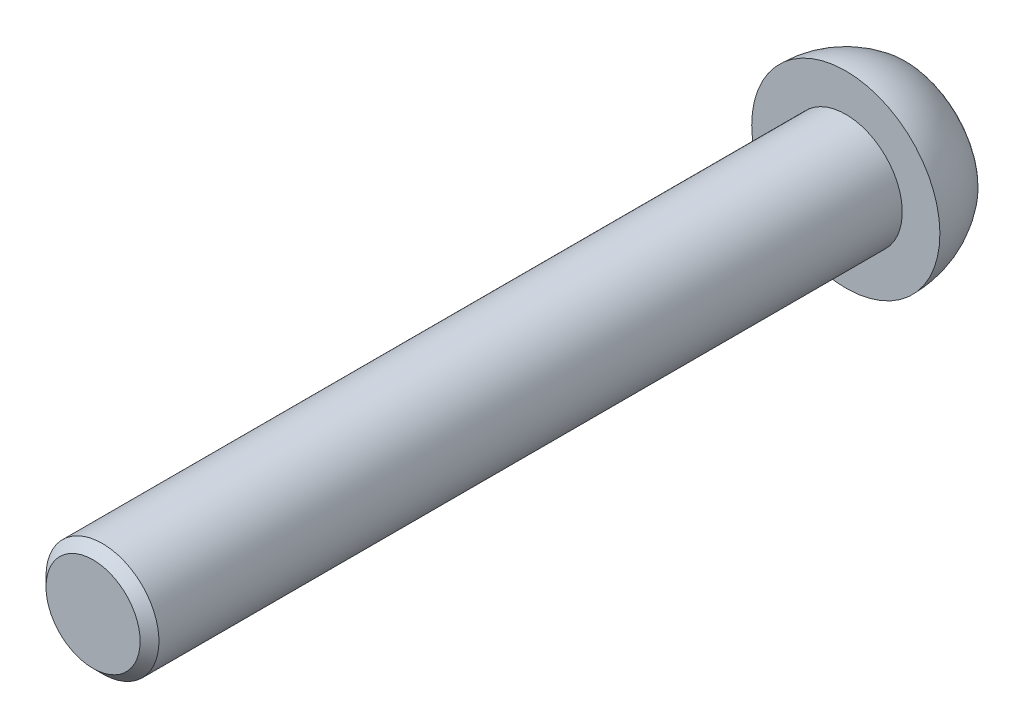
ISO-10303-21;
HEADER;
FILE_DESCRIPTION(('STEP AP214'),'2;1');
FILE_NAME('part.step','',(''),(''),'','','');
FILE_SCHEMA(('AUTOMOTIVE_DESIGN { 1 0 10303 214 1 1 1 1 }'));
ENDSEC;
DATA;
#1=APPLICATION_CONTEXT('core data for automotive mechanical design processes');
#2=APPLICATION_PROTOCOL_DEFINITION('international standard','automotive_design',2000,#1);
#3=PRODUCT_CONTEXT('',#1,'mechanical');
#4=PRODUCT('Part','Part','',(#3));
#5=PRODUCT_RELATED_PRODUCT_CATEGORY('part','',(#4));
#6=PRODUCT_DEFINITION_FORMATION('','',#4);
#7=PRODUCT_DEFINITION_CONTEXT('part definition',#1,'design');
#8=PRODUCT_DEFINITION('design','',#6,#7);
#9=PRODUCT_DEFINITION_SHAPE('','',#8);
#10=(LENGTH_UNIT() NAMED_UNIT(*) SI_UNIT(.MILLI.,.METRE.));
#11=(NAMED_UNIT(*) PLANE_ANGLE_UNIT() SI_UNIT($,.RADIAN.));
#12=(NAMED_UNIT(*) SI_UNIT($,.STERADIAN.) SOLID_ANGLE_UNIT());
#13=UNCERTAINTY_MEASURE_WITH_UNIT(LENGTH_MEASURE(1.E-05),#10,'distance_accuracy_value','');
#14=(GEOMETRIC_REPRESENTATION_CONTEXT(3) GLOBAL_UNCERTAINTY_ASSIGNED_CONTEXT((#13)) GLOBAL_UNIT_ASSIGNED_CONTEXT((#10,
#11,#12)) REPRESENTATION_CONTEXT('',''));
#15=CARTESIAN_POINT('',(0.,0.,0.));
#16=DIRECTION('',(0.,0.,1.));
#17=DIRECTION('',(1.,0.,0.));
#18=AXIS2_PLACEMENT_3D('',#15,#16,#17);
#19=CARTESIAN_POINT('',(-62.1361919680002,258.189999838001,-24.0000000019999));
#20=DIRECTION('',(0.,0.,-0.999999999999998));
#21=DIRECTION('',(0.99035023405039,0.138587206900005,0.));
#22=AXIS2_PLACEMENT_3D('',#19,#20,#21);
#23=PLANE('',#22);
#24=DIRECTION('',(0.3751550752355,0.926962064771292,0.));
#25=VECTOR('',#24,1.);
#26=CARTESIAN_POINT('',(-61.2958197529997,257.113059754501,-24.0000000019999));
#27=LINE('',#26,#25);
#28=CARTESIAN_POINT('',(-61.8082911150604,255.846806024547,-24.0000000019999));
#29=VERTEX_POINT('',#28);
#30=CARTESIAN_POINT('',(-60.7833483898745,258.379313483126,-24.0000000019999));
#31=VERTEX_POINT('',#30);
#32=EDGE_CURVE('E123',#29,#31,#27,.T.);
#33=ORIENTED_EDGE('',*,*,#32,.T.);
#34=DIRECTION('',(0.990350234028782,0.13858720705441,0.));
#35=VECTOR('',#34,1.);
#36=CARTESIAN_POINT('',(-59.4305048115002,258.568627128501,-24.0000000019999));
#37=LINE('',#36,#35);
#38=CARTESIAN_POINT('',(-58.0776612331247,258.757940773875,-24.0000000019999));
#39=VERTEX_POINT('',#38);
#40=EDGE_CURVE('E103',#31,#39,#37,.T.);
#41=ORIENTED_EDGE('',*,*,#40,.T.);
#42=DIRECTION('',(0.615195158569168,-0.788374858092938,0.));
#43=VECTOR('',#42,1.);
#44=CARTESIAN_POINT('',(-57.2372890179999,257.681000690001,-24.0000000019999));
#45=LINE('',#44,#43);
#46=CARTESIAN_POINT('',(-56.3969168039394,256.604060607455,-24.0000000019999));
#47=VERTEX_POINT('',#46);
#48=EDGE_CURVE('E99',#39,#47,#45,.T.);
#49=ORIENTED_EDGE('',*,*,#48,.T.);
#50=DIRECTION('',(-0.375155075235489,-0.926962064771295,0.));
#51=VECTOR('',#50,1.);
#52=CARTESIAN_POINT('',(-56.9093881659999,255.337806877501,-24.0000000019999));
#53=LINE('',#52,#51);
#54=CARTESIAN_POINT('',(-57.4218595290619,254.071553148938,-24.0000000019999));
#55=VERTEX_POINT('',#54);
#56=EDGE_CURVE('E101',#47,#55,#53,.T.);
#57=ORIENTED_EDGE('',*,*,#56,.T.);
#58=DIRECTION('',(-0.990350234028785,-0.13858720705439,0.));
#59=VECTOR('',#58,1.);
#60=CARTESIAN_POINT('',(-58.7747031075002,253.882239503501,-24.0000000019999));
#61=LINE('',#60,#59);
#62=CARTESIAN_POINT('',(-60.1275466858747,253.692925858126,-24.0000000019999));
#63=VERTEX_POINT('',#62);
#64=EDGE_CURVE('E85',#55,#63,#61,.T.);
#65=ORIENTED_EDGE('',*,*,#64,.T.);
#66=DIRECTION('',(-0.615195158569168,0.788374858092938,0.));
#67=VECTOR('',#66,1.);
#68=CARTESIAN_POINT('',(-60.9679189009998,254.769865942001,-24.0000000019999));
#69=LINE('',#68,#67);
#70=EDGE_CURVE('E130',#63,#29,#69,.T.);
#71=ORIENTED_EDGE('',*,*,#70,.T.);
#72=EDGE_LOOP('',(#33,#41,#49,#57,#65,#71));
#73=FACE_BOUND('',#72,.T.);
#74=ADVANCED_FACE('F30',(#73),#23,.T.);
#75=CARTESIAN_POINT('',(-59.1026039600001,256.225433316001,-8.000000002));
#76=DIRECTION('',(0.,0.,-0.999999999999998));
#77=DIRECTION('',(-1.,0.,0.));
#78=AXIS2_PLACEMENT_3D('',#75,#76,#77);
#79=CYLINDRICAL_SURFACE('',#78,3.00000000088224);
#80=CARTESIAN_POINT('',(-59.1026039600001,256.225433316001,16.4999999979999));
#81=DIRECTION('',(0.,0.,1.));
#82=DIRECTION('',(1.,0.,0.));
#83=AXIS2_PLACEMENT_3D('',#80,#81,#82);
#84=CIRCLE('',#83,3.00000000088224);
#85=CARTESIAN_POINT('',(-62.1026039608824,256.225433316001,16.4999999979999));
#86=VERTEX_POINT('',#85);
#87=EDGE_CURVE('E11',#86,#86,#84,.F.);
#88=CARTESIAN_POINT('',(-59.1026039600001,256.225433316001,-23.000000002));
#89=DIRECTION('',(0.,0.,-0.999999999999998));
#90=DIRECTION('',(-1.,0.,0.));
#91=AXIS2_PLACEMENT_3D('',#88,#89,#90);
#92=CIRCLE('',#91,3.00000000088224);
#93=CARTESIAN_POINT('',(-62.1026039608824,256.225433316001,-23.000000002));
#94=VERTEX_POINT('',#93);
#95=EDGE_CURVE('E144',#94,#94,#92,.F.);
#96=CARTESIAN_POINT('',(-62.1026039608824,256.225433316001,16.4999999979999));
#97=CARTESIAN_POINT('',(-62.1026039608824,256.225433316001,16.0885416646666));
#98=CARTESIAN_POINT('',(-62.1026039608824,256.225433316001,15.6770833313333));
#99=CARTESIAN_POINT('',(-62.1026039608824,256.225433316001,14.8541666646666));
#100=CARTESIAN_POINT('',(-62.1026039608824,256.225433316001,14.4427083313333));
#101=CARTESIAN_POINT('',(-62.1026039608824,256.225433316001,13.6197916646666));
#102=CARTESIAN_POINT('',(-62.1026039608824,256.225433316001,13.2083333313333));
#103=CARTESIAN_POINT('',(-62.1026039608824,256.225433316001,12.3854166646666));
#104=CARTESIAN_POINT('',(-62.1026039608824,256.225433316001,11.9739583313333));
#105=CARTESIAN_POINT('',(-62.1026039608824,256.225433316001,11.1510416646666));
#106=CARTESIAN_POINT('',(-62.1026039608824,256.225433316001,10.7395833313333));
#107=CARTESIAN_POINT('',(-62.1026039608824,256.225433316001,9.91666666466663));
#108=CARTESIAN_POINT('',(-62.1026039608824,256.225433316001,9.5052083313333));
#109=CARTESIAN_POINT('',(-62.1026039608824,256.225433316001,8.68229166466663));
#110=CARTESIAN_POINT('',(-62.1026039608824,256.225433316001,8.2708333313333));
#111=CARTESIAN_POINT('',(-62.1026039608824,256.225433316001,7.44791666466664));
#112=CARTESIAN_POINT('',(-62.1026039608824,256.225433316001,7.0364583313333));
#113=CARTESIAN_POINT('',(-62.1026039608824,256.225433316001,6.21354166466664));
#114=CARTESIAN_POINT('',(-62.1026039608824,256.225433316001,5.80208333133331));
#115=CARTESIAN_POINT('',(-62.1026039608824,256.225433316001,4.97916666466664));
#116=CARTESIAN_POINT('',(-62.1026039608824,256.225433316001,4.56770833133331));
#117=CARTESIAN_POINT('',(-62.1026039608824,256.225433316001,3.74479166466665));
#118=CARTESIAN_POINT('',(-62.1026039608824,256.225433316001,3.33333333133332));
#119=CARTESIAN_POINT('',(-62.1026039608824,256.225433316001,2.51041666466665));
#120=CARTESIAN_POINT('',(-62.1026039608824,256.225433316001,2.09895833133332));
#121=CARTESIAN_POINT('',(-62.1026039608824,256.225433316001,1.27604166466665));
#122=CARTESIAN_POINT('',(-62.1026039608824,256.225433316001,0.86458333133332));
#123=CARTESIAN_POINT('',(-62.1026039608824,256.225433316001,0.0416666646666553));
#124=CARTESIAN_POINT('',(-62.1026039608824,256.225433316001,-0.369791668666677));
#125=CARTESIAN_POINT('',(-62.1026039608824,256.225433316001,-1.19270833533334));
#126=CARTESIAN_POINT('',(-62.1026039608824,256.225433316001,-1.60416666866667));
#127=CARTESIAN_POINT('',(-62.1026039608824,256.225433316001,-2.42708333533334));
#128=CARTESIAN_POINT('',(-62.1026039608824,256.225433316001,-2.83854166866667));
#129=CARTESIAN_POINT('',(-62.1026039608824,256.225433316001,-3.66145833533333));
#130=CARTESIAN_POINT('',(-62.1026039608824,256.225433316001,-4.07291666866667));
#131=CARTESIAN_POINT('',(-62.1026039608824,256.225433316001,-4.89583333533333));
#132=CARTESIAN_POINT('',(-62.1026039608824,256.225433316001,-5.30729166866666));
#133=CARTESIAN_POINT('',(-62.1026039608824,256.225433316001,-6.13020833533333));
#134=CARTESIAN_POINT('',(-62.1026039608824,256.225433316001,-6.54166666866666));
#135=CARTESIAN_POINT('',(-62.1026039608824,256.225433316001,-7.36458333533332));
#136=CARTESIAN_POINT('',(-62.1026039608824,256.225433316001,-7.77604166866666));
#137=CARTESIAN_POINT('',(-62.1026039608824,256.225433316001,-8.59895833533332));
#138=CARTESIAN_POINT('',(-62.1026039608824,256.225433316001,-9.01041666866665));
#139=CARTESIAN_POINT('',(-62.1026039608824,256.225433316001,-9.83333333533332));
#140=CARTESIAN_POINT('',(-62.1026039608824,256.225433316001,-10.2447916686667));
#141=CARTESIAN_POINT('',(-62.1026039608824,256.225433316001,-11.0677083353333));
#142=CARTESIAN_POINT('',(-62.1026039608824,256.225433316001,-11.4791666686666));
#143=CARTESIAN_POINT('',(-62.1026039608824,256.225433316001,-12.3020833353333));
#144=CARTESIAN_POINT('',(-62.1026039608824,256.225433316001,-12.7135416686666));
#145=CARTESIAN_POINT('',(-62.1026039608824,256.225433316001,-13.5364583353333));
#146=CARTESIAN_POINT('',(-62.1026039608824,256.225433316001,-13.9479166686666));
#147=CARTESIAN_POINT('',(-62.1026039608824,256.225433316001,-14.7708333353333));
#148=CARTESIAN_POINT('',(-62.1026039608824,256.225433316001,-15.1822916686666));
#149=CARTESIAN_POINT('',(-62.1026039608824,256.225433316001,-16.0052083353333));
#150=CARTESIAN_POINT('',(-62.1026039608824,256.225433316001,-16.4166666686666));
#151=CARTESIAN_POINT('',(-62.1026039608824,256.225433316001,-17.2395833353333));
#152=CARTESIAN_POINT('',(-62.1026039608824,256.225433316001,-17.6510416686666));
#153=CARTESIAN_POINT('',(-62.1026039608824,256.225433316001,-18.4739583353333));
#154=CARTESIAN_POINT('',(-62.1026039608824,256.225433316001,-18.8854166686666));
#155=CARTESIAN_POINT('',(-62.1026039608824,256.225433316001,-19.7083333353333));
#156=CARTESIAN_POINT('',(-62.1026039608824,256.225433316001,-20.1197916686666));
#157=CARTESIAN_POINT('',(-62.1026039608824,256.225433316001,-20.9427083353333));
#158=CARTESIAN_POINT('',(-62.1026039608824,256.225433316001,-21.3541666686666));
#159=CARTESIAN_POINT('',(-62.1026039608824,256.225433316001,-22.1770833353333));
#160=CARTESIAN_POINT('',(-62.1026039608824,256.225433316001,-22.5885416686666));
#161=CARTESIAN_POINT('',(-62.1026039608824,256.225433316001,-23.000000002));
#162=B_SPLINE_CURVE_WITH_KNOTS('',3,(#96,#97,#98,#99,#100,#101,#102,#103,#104,#105,#106,#107,
#108,#109,#110,#111,#112,#113,#114,#115,#116,#117,#118,#119,#120,#121,#122,#123,#124,#125,#126,
#127,#128,#129,#130,#131,#132,#133,#134,#135,#136,#137,#138,#139,#140,#141,#142,#143,#144,#145,
#146,#147,#148,#149,#150,#151,#152,#153,#154,#155,#156,#157,#158,#159,#160,#161),.UNSPECIFIED.,
.F.,.F.,(4,2,2,2,2,2,2,2,2,2,2,2,2,2,2,2,2,2,2,2,2,2,2,2,2,2,2,2,2,2,2,2,4),(0.,1.234375,
2.46874999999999,3.70312499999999,4.93749999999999,6.17187499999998,7.40624999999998,
8.64062499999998,9.87499999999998,11.109375,12.34375,13.578125,14.8125,16.046875,17.28125,
18.515625,19.7499999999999,20.9843749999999,22.2187499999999,23.4531249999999,24.6874999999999,
25.9218749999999,27.1562499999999,28.3906249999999,29.6249999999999,30.8593749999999,
32.0937499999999,33.3281249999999,34.5624999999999,35.7968749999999,37.0312499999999,
38.2656249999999,39.4999999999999),.UNSPECIFIED.);
#163=EDGE_CURVE('BSEAM187',#86,#94,#162,.T.);
#164=ORIENTED_EDGE('',*,*,#87,.T.);
#165=ORIENTED_EDGE('',*,*,#95,.T.);
#166=ORIENTED_EDGE('',*,*,#163,.T.);
#167=ORIENTED_EDGE('',*,*,#163,.F.);
#168=EDGE_LOOP('',(#164,#166,#165,#167));
#169=FACE_BOUND('',#168,.T.);
#170=ADVANCED_FACE('F187',(#169),#79,.T.);
#171=CARTESIAN_POINT('',(-57.4218595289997,254.071553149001,-26.3000000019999));
#172=DIRECTION('',(0.926962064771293,-0.375155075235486,0.));
#173=DIRECTION('',(0.375155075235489,0.926962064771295,0.));
#174=AXIS2_PLACEMENT_3D('',#171,#172,#173);
#175=PLANE('',#174);
#176=DIRECTION('',(0.,0.,0.999999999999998));
#177=VECTOR('',#176,1.);
#178=CARTESIAN_POINT('',(-57.4218595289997,254.071553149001,-25.1500000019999));
#179=LINE('',#178,#177);
#180=CARTESIAN_POINT('',(-57.4218595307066,254.071553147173,-26.3000000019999));
#181=VERTEX_POINT('',#180);
#182=EDGE_CURVE('E111',#181,#55,#179,.T.);
#183=ORIENTED_EDGE('',*,*,#182,.T.);
#184=ORIENTED_EDGE('',*,*,#56,.F.);
#185=DIRECTION('',(0.,0.,-0.999999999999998));
#186=VECTOR('',#185,1.);
#187=CARTESIAN_POINT('',(-56.396916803,256.604060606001,-25.1500000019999));
#188=LINE('',#187,#186);
#189=CARTESIAN_POINT('',(-56.3969168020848,256.604060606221,-26.3000000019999));
#190=VERTEX_POINT('',#189);
#191=EDGE_CURVE('E107',#47,#190,#188,.T.);
#192=ORIENTED_EDGE('',*,*,#191,.T.);
#193=DIRECTION('',(0.37515507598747,0.926962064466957,0.));
#194=VECTOR('',#193,1.);
#195=CARTESIAN_POINT('',(-57.4218595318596,254.07155314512,-26.3000000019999));
#196=LINE('',#195,#194);
#197=EDGE_CURVE('E76',#181,#190,#196,.T.);
#198=ORIENTED_EDGE('',*,*,#197,.F.);
#199=EDGE_LOOP('',(#183,#184,#192,#198));
#200=FACE_BOUND('',#199,.T.);
#201=ADVANCED_FACE('F109',(#200),#175,.F.);
#202=CARTESIAN_POINT('',(-56.396916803,256.604060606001,-26.3000000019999));
#203=DIRECTION('',(0.788374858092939,0.615195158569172,0.));
#204=DIRECTION('',(-0.615195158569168,0.788374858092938,0.));
#205=AXIS2_PLACEMENT_3D('',#202,#203,#204);
#206=PLANE('',#205);
#207=ORIENTED_EDGE('',*,*,#191,.F.);
#208=ORIENTED_EDGE('',*,*,#48,.F.);
#209=DIRECTION('',(0.,0.,-0.999999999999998));
#210=VECTOR('',#209,1.);
#211=CARTESIAN_POINT('',(-58.0776612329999,258.757940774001,-25.1500000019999));
#212=LINE('',#211,#210);
#213=CARTESIAN_POINT('',(-58.077661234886,258.757940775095,-26.3000000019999));
#214=VERTEX_POINT('',#213);
#215=EDGE_CURVE('E117',#39,#214,#212,.T.);
#216=ORIENTED_EDGE('',*,*,#215,.T.);
#217=DIRECTION('',(-0.615195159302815,0.788374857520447,0.));
#218=VECTOR('',#217,1.);
#219=CARTESIAN_POINT('',(-56.3969168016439,256.604060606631,-26.3000000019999));
#220=LINE('',#219,#218);
#221=EDGE_CURVE('E115',#190,#214,#220,.T.);
#222=ORIENTED_EDGE('',*,*,#221,.F.);
#223=EDGE_LOOP('',(#207,#208,#216,#222));
#224=FACE_BOUND('',#223,.T.);
#225=ADVANCED_FACE('F113',(#224),#206,.F.);
#226=CARTESIAN_POINT('',(-58.0776612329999,258.757940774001,-24.0000000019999));
#227=DIRECTION('',(-0.138587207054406,0.990350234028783,0.));
#228=DIRECTION('',(0.,0.,-0.999999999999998));
#229=AXIS2_PLACEMENT_3D('',#226,#227,#228);
#230=PLANE('',#229);
#231=ORIENTED_EDGE('',*,*,#215,.F.);
#232=ORIENTED_EDGE('',*,*,#40,.F.);
#233=DIRECTION('',(0.,0.,-0.999999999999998));
#234=VECTOR('',#233,1.);
#235=CARTESIAN_POINT('',(-60.7833483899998,258.379313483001,-25.1500000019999));
#236=LINE('',#235,#234);
#237=CARTESIAN_POINT('',(-60.7833483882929,258.379313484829,-26.3000000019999));
#238=VERTEX_POINT('',#237);
#239=EDGE_CURVE('E128',#31,#238,#236,.T.);
#240=ORIENTED_EDGE('',*,*,#239,.T.);
#241=DIRECTION('',(-0.990350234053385,-0.138587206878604,0.));
#242=VECTOR('',#241,1.);
#243=CARTESIAN_POINT('',(-59.4305048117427,258.568627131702,-26.3000000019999));
#244=LINE('',#243,#242);
#245=EDGE_CURVE('E124',#214,#238,#244,.T.);
#246=ORIENTED_EDGE('',*,*,#245,.F.);
#247=EDGE_LOOP('',(#231,#232,#240,#246));
#248=FACE_BOUND('',#247,.T.);
#249=ADVANCED_FACE('F214',(#248),#230,.F.);
#250=CARTESIAN_POINT('',(-60.7833483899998,258.379313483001,-26.3000000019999));
#251=DIRECTION('',(-0.926962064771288,0.375155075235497,0.));
#252=DIRECTION('',(-0.3751550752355,-0.926962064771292,0.));
#253=AXIS2_PLACEMENT_3D('',#250,#251,#252);
#254=PLANE('',#253);
#255=ORIENTED_EDGE('',*,*,#239,.F.);
#256=ORIENTED_EDGE('',*,*,#32,.F.);
#257=DIRECTION('',(0.,0.,-0.999999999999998));
#258=VECTOR('',#257,1.);
#259=CARTESIAN_POINT('',(-61.8082911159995,255.846806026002,-25.1500000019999));
#260=LINE('',#259,#258);
#261=CARTESIAN_POINT('',(-61.8082911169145,255.846806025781,-26.3000000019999));
#262=VERTEX_POINT('',#261);
#263=EDGE_CURVE('E208',#29,#262,#260,.T.);
#264=ORIENTED_EDGE('',*,*,#263,.T.);
#265=DIRECTION('',(-0.375155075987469,-0.926962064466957,0.));
#266=VECTOR('',#265,1.);
#267=CARTESIAN_POINT('',(-60.7833483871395,258.379313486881,-26.3000000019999));
#268=LINE('',#267,#266);
#269=EDGE_CURVE('E127',#238,#262,#268,.T.);
#270=ORIENTED_EDGE('',*,*,#269,.F.);
#271=EDGE_LOOP('',(#255,#256,#264,#270));
#272=FACE_BOUND('',#271,.T.);
#273=ADVANCED_FACE('F217',(#272),#254,.F.);
#274=CARTESIAN_POINT('',(-61.8082911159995,255.846806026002,-26.3000000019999));
#275=DIRECTION('',(-0.788374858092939,-0.615195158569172,0.));
#276=DIRECTION('',(0.615195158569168,-0.788374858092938,0.));
#277=AXIS2_PLACEMENT_3D('',#274,#275,#276);
#278=PLANE('',#277);
#279=ORIENTED_EDGE('',*,*,#263,.F.);
#280=ORIENTED_EDGE('',*,*,#70,.F.);
#281=DIRECTION('',(0.,0.,-0.999999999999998));
#282=VECTOR('',#281,1.);
#283=CARTESIAN_POINT('',(-60.1275466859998,253.692925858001,-25.1500000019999));
#284=LINE('',#283,#282);
#285=CARTESIAN_POINT('',(-60.1275466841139,253.692925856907,-26.3000000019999));
#286=VERTEX_POINT('',#285);
#287=EDGE_CURVE('E206',#63,#286,#284,.T.);
#288=ORIENTED_EDGE('',*,*,#287,.T.);
#289=DIRECTION('',(0.615195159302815,-0.788374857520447,0.));
#290=VECTOR('',#289,1.);
#291=CARTESIAN_POINT('',(-61.8082911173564,255.84680602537,-26.3000000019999));
#292=LINE('',#291,#290);
#293=EDGE_CURVE('E135',#262,#286,#292,.T.);
#294=ORIENTED_EDGE('',*,*,#293,.F.);
#295=EDGE_LOOP('',(#279,#280,#288,#294));
#296=FACE_BOUND('',#295,.T.);
#297=ADVANCED_FACE('F289',(#296),#278,.F.);
#298=CARTESIAN_POINT('',(-57.4218595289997,254.071553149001,-26.3000000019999));
#299=DIRECTION('',(0.138587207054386,-0.990350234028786,0.));
#300=DIRECTION('',(0.,0.,0.999999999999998));
#301=AXIS2_PLACEMENT_3D('',#298,#299,#300);
#302=PLANE('',#301);
#303=ORIENTED_EDGE('',*,*,#287,.F.);
#304=ORIENTED_EDGE('',*,*,#64,.F.);
#305=ORIENTED_EDGE('',*,*,#182,.F.);
#306=DIRECTION('',(0.990350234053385,0.138587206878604,0.));
#307=VECTOR('',#306,1.);
#308=CARTESIAN_POINT('',(-58.7747031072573,253.8822395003,-26.3000000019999));
#309=LINE('',#308,#307);
#310=EDGE_CURVE('E138',#286,#181,#309,.T.);
#311=ORIENTED_EDGE('',*,*,#310,.F.);
#312=EDGE_LOOP('',(#303,#304,#305,#311));
#313=FACE_BOUND('',#312,.T.);
#314=ADVANCED_FACE('F186',(#313),#302,.F.);
#315=CARTESIAN_POINT('',(-59.5908166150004,259.714222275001,-26.300000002));
#316=CARTESIAN_POINT('',(-52.6132386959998,260.690647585,-26.300000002));
#317=CARTESIAN_POINT('',(-51.6368133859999,253.713069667,-26.300000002));
#318=CARTESIAN_POINT('',(-58.614391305,252.736644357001,-26.3000000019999));
#319=CARTESIAN_POINT('',(-59.612318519,259.867875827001,-26.3000000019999));
#320=CARTESIAN_POINT('',(-52.3274334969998,260.887304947,-26.3000000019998));
#321=CARTESIAN_POINT('',(-51.3080043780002,253.602419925,-26.3000000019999));
#322=CARTESIAN_POINT('',(-58.5928894,252.582990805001,-26.3000000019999));
#323=CARTESIAN_POINT('',(-59.6316835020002,260.006258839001,-26.2325694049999));
#324=CARTESIAN_POINT('',(-52.0700324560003,261.064417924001,-26.2325694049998));
#325=CARTESIAN_POINT('',(-51.0118733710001,253.502766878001,-26.2325694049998));
#326=CARTESIAN_POINT('',(-58.5735244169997,252.444607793,-26.2325694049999));
#327=CARTESIAN_POINT('',(-59.645062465,260.101865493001,-26.111111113));
#328=CARTESIAN_POINT('',(-51.8921981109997,261.186782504,-26.111111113));
#329=CARTESIAN_POINT('',(-50.8072811,253.433918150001,-26.111111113));
#330=CARTESIAN_POINT('',(-58.5601454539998,252.349001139,-26.1111111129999));
#331=(BOUNDED_SURFACE() B_SPLINE_SURFACE(3,3,((#315,#316,#317,#318),(#319,#320,#321,#322),(#323,
#324,#325,#326),(#327,#328,#329,#330)),.UNSPECIFIED.,.F.,.F.,
.F.) B_SPLINE_SURFACE_WITH_KNOTS((4,4),(4,4),(0.,1.),(0.,1.),
.UNSPECIFIED.) GEOMETRIC_REPRESENTATION_ITEM() RATIONAL_B_SPLINE_SURFACE(((1.,0.333333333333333,
0.333333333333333,1.),(0.933744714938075,0.311248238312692,0.311248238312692,0.933744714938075),
(0.933744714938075,0.311248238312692,0.311248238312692,0.933744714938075),(1.,0.333333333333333,
0.333333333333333,1.))) REPRESENTATION_ITEM('') SURFACE());
#332=CARTESIAN_POINT('',(-58.614391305,252.736644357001,-26.3000000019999));
#333=CARTESIAN_POINT('',(-58.5928894,252.582990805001,-26.3000000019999));
#334=CARTESIAN_POINT('',(-58.5735244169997,252.444607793,-26.2325694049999));
#335=CARTESIAN_POINT('',(-58.5601454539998,252.349001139,-26.1111111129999));
#336=(BOUNDED_CURVE() B_SPLINE_CURVE(3,(#332,#333,#334,#335),.UNSPECIFIED.,.F.,
.F.) B_SPLINE_CURVE_WITH_KNOTS((4,4),(0.,1.),
.UNSPECIFIED.) CURVE() GEOMETRIC_REPRESENTATION_ITEM() RATIONAL_B_SPLINE_CURVE((1.,
0.933744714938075,0.933744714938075,1.)) REPRESENTATION_ITEM(''));
#337=CARTESIAN_POINT('',(-58.5601454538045,252.349001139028,-26.1111111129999));
#338=VERTEX_POINT('',#337);
#339=CARTESIAN_POINT('',(-58.614391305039,252.736644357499,-26.3000000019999));
#340=VERTEX_POINT('',#339);
#341=EDGE_CURVE('E146',#338,#340,#336,.F.);
#342=CARTESIAN_POINT('',(-58.614391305,252.736644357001,-26.3000000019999));
#343=CARTESIAN_POINT('',(-51.6368133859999,253.713069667,-26.300000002));
#344=CARTESIAN_POINT('',(-52.6132386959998,260.690647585,-26.300000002));
#345=CARTESIAN_POINT('',(-59.5908166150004,259.714222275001,-26.300000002));
#346=(BOUNDED_CURVE() B_SPLINE_CURVE(3,(#342,#343,#344,#345),.UNSPECIFIED.,.F.,
.F.) B_SPLINE_CURVE_WITH_KNOTS((4,4),(0.,1.),
.UNSPECIFIED.) CURVE() GEOMETRIC_REPRESENTATION_ITEM() RATIONAL_B_SPLINE_CURVE((1.,
0.333333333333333,0.333333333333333,1.)) REPRESENTATION_ITEM(''));
#347=CARTESIAN_POINT('',(-59.5908166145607,259.714222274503,-26.300000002));
#348=VERTEX_POINT('',#347);
#349=EDGE_CURVE('E143',#348,#340,#346,.F.);
#350=CARTESIAN_POINT('',(-59.5908166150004,259.714222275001,-26.300000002));
#351=CARTESIAN_POINT('',(-59.612318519,259.867875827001,-26.3000000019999));
#352=CARTESIAN_POINT('',(-59.6316835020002,260.006258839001,-26.2325694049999));
#353=CARTESIAN_POINT('',(-59.645062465,260.101865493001,-26.111111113));
#354=(BOUNDED_CURVE() B_SPLINE_CURVE(3,(#350,#351,#352,#353),.UNSPECIFIED.,.F.,
.F.) B_SPLINE_CURVE_WITH_KNOTS((4,4),(0.,1.),
.UNSPECIFIED.) CURVE() GEOMETRIC_REPRESENTATION_ITEM() RATIONAL_B_SPLINE_CURVE((1.,
0.933744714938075,0.933744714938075,1.)) REPRESENTATION_ITEM(''));
#355=CARTESIAN_POINT('',(-59.6450624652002,260.101865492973,-26.111111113));
#356=VERTEX_POINT('',#355);
#357=EDGE_CURVE('E229',#348,#356,#354,.T.);
#358=CARTESIAN_POINT('',(-59.1026039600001,256.225433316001,-26.1111110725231));
#359=DIRECTION('',(0.,0.,-0.999999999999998));
#360=DIRECTION('',(-0.990350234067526,-0.138587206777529,0.));
#361=AXIS2_PLACEMENT_3D('',#358,#359,#360);
#362=CIRCLE('',#361,3.91420335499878);
#363=EDGE_CURVE('E134',#356,#338,#362,.T.);
#364=ORIENTED_EDGE('',*,*,#341,.T.);
#365=ORIENTED_EDGE('',*,*,#349,.F.);
#366=ORIENTED_EDGE('',*,*,#357,.T.);
#367=ORIENTED_EDGE('',*,*,#363,.T.);
#368=EDGE_LOOP('',(#364,#365,#366,#367));
#369=FACE_BOUND('',#368,.T.);
#370=ADVANCED_FACE('F173',(#369),#331,.T.);
#371=CARTESIAN_POINT('',(-64.8150274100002,260.535354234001,-23.000000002));
#372=DIRECTION('',(0.,0.,-0.999999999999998));
#373=DIRECTION('',(0.9903502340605,0.138587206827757,0.));
#374=AXIS2_PLACEMENT_3D('',#371,#372,#373);
#375=PLANE('',#374);
#376=ORIENTED_EDGE('',*,*,#95,.F.);
#377=EDGE_LOOP('',(#376));
#378=FACE_BOUND('',#377,.T.);
#379=CARTESIAN_POINT('',(-59.1026039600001,256.225433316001,-23.000000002));
#380=DIRECTION('',(0.,0.,-0.999999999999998));
#381=DIRECTION('',(-1.,0.,0.));
#382=AXIS2_PLACEMENT_3D('',#379,#380,#381);
#383=CIRCLE('',#382,4.99999999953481);
#384=CARTESIAN_POINT('',(-64.1026039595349,256.225433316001,-23.000000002));
#385=VERTEX_POINT('',#384);
#386=EDGE_CURVE('E131',#385,#385,#383,.F.);
#387=ORIENTED_EDGE('',*,*,#386,.T.);
#388=EDGE_LOOP('',(#387));
#389=FACE_BOUND('',#388,.T.);
#390=ADVANCED_FACE('F185',(#378,#389),#375,.F.);
#391=CARTESIAN_POINT('',(-56.0660207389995,260.250158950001,-26.300000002));
#392=DIRECTION('',(0.,0.,-0.999999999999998));
#393=DIRECTION('',(0.13858720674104,-0.990350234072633,0.));
#394=AXIS2_PLACEMENT_3D('',#391,#392,#393);
#395=PLANE('',#394);
#396=ORIENTED_EDGE('',*,*,#293,.T.);
#397=ORIENTED_EDGE('',*,*,#310,.T.);
#398=ORIENTED_EDGE('',*,*,#197,.T.);
#399=ORIENTED_EDGE('',*,*,#221,.T.);
#400=ORIENTED_EDGE('',*,*,#245,.T.);
#401=ORIENTED_EDGE('',*,*,#269,.T.);
#402=EDGE_LOOP('',(#396,#397,#398,#399,#400,#401));
#403=FACE_BOUND('',#402,.T.);
#404=CARTESIAN_POINT('',(-59.5908166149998,259.714222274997,-26.300000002));
#405=CARTESIAN_POINT('',(-59.6277319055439,259.709056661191,-26.300000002));
#406=CARTESIAN_POINT('',(-59.6645651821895,259.703304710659,-26.300000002));
#407=CARTESIAN_POINT('',(-59.739195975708,259.690433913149,-26.300000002));
#408=CARTESIAN_POINT('',(-59.7769870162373,259.683277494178,-26.300000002));
#409=CARTESIAN_POINT('',(-59.853507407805,259.667484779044,-26.300000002));
#410=CARTESIAN_POINT('',(-59.8922285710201,259.658808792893,-26.300000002));
#411=CARTESIAN_POINT('',(-59.9705737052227,259.639859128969,-26.300000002));
#412=CARTESIAN_POINT('',(-60.0101875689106,259.62954364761,-26.300000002));
#413=CARTESIAN_POINT('',(-60.0902717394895,259.607192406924,-26.300000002));
#414=CARTESIAN_POINT('',(-60.1307297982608,259.595112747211,-26.300000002));
#415=CARTESIAN_POINT('',(-60.2124438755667,259.569106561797,-26.300000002));
#416=CARTESIAN_POINT('',(-60.2536852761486,259.555134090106,-26.300000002));
#417=CARTESIAN_POINT('',(-60.3368941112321,259.525212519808,-26.300000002));
#418=CARTESIAN_POINT('',(-60.3788443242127,259.509215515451,-26.300000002));
#419=CARTESIAN_POINT('',(-60.4633840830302,259.475113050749,-26.300000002));
#420=CARTESIAN_POINT('',(-60.5059535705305,259.456957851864,-26.300000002));
#421=CARTESIAN_POINT('',(-60.5916290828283,259.418406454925,-26.300000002));
#422=CARTESIAN_POINT('',(-60.6347119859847,259.397958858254,-26.300000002));
#423=CARTESIAN_POINT('',(-60.7212941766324,259.354691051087,-26.300000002));
#424=CARTESIAN_POINT('',(-60.7647670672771,259.331818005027,-26.300000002));
#425=CARTESIAN_POINT('',(-60.851990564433,259.283570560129,-26.300000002));
#426=CARTESIAN_POINT('',(-60.8957113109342,259.2581421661,-26.300000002));
#427=CARTESIAN_POINT('',(-60.9832723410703,259.204660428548,-26.300000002));
#428=CARTESIAN_POINT('',(-61.0270791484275,259.176552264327,-26.300000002));
#429=CARTESIAN_POINT('',(-61.1146338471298,259.117595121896,-26.300000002));
#430=CARTESIAN_POINT('',(-61.158344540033,259.086690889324,-26.300000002));
#431=CARTESIAN_POINT('',(-61.2455078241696,259.022036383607,-26.300000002));
#432=CARTESIAN_POINT('',(-61.2889194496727,258.98823087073,-26.300000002));
#433=CARTESIAN_POINT('',(-61.3752646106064,258.917682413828,-26.300000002));
#434=CARTESIAN_POINT('',(-61.4181534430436,258.880884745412,-26.300000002));
#435=CARTESIAN_POINT('',(-61.503212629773,258.804277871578,-26.300000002));
#436=CARTESIAN_POINT('',(-61.5453346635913,258.764415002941,-26.300000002));
#437=CARTESIAN_POINT('',(-61.6286004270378,258.681624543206,-26.300000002));
#438=CARTESIAN_POINT('',(-61.6696924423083,258.638644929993,-26.300000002));
#439=CARTESIAN_POINT('',(-61.7506205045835,258.549592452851,-26.300000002));
#440=CARTESIAN_POINT('',(-61.7904017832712,258.503469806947,-26.300000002));
#441=CARTESIAN_POINT('',(-61.8684151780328,258.408131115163,-26.300000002));
#442=CARTESIAN_POINT('',(-61.9065899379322,258.358868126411,-26.300000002));
#443=CARTESIAN_POINT('',(-61.981084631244,258.257280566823,-26.300000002));
#444=CARTESIAN_POINT('',(-62.0173452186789,258.204912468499,-26.300000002));
#445=CARTESIAN_POINT('',(-62.087697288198,258.097181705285,-26.300000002));
#446=CARTESIAN_POINT('',(-62.12172816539,258.041779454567,-26.300000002));
#447=CARTESIAN_POINT('',(-62.1873024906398,257.928085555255,-26.300000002));
#448=CARTESIAN_POINT('',(-62.2187849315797,257.869758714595,-26.300000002));
#449=CARTESIAN_POINT('',(-62.2789455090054,257.750360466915,-26.300000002));
#450=CARTESIAN_POINT('',(-62.3075632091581,257.689258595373,-26.300000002));
#451=CARTESIAN_POINT('',(-62.3616842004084,257.564498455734,-26.300000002));
#452=CARTESIAN_POINT('',(-62.3871286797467,257.500814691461,-26.300000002));
#453=CARTESIAN_POINT('',(-62.4346087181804,257.371113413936,-26.300000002));
#454=CARTESIAN_POINT('',(-62.4565882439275,257.305075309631,-26.300000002));
#455=CARTESIAN_POINT('',(-62.4866944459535,257.204803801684,-26.300000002));
#456=CARTESIAN_POINT('',(-62.4962933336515,257.171005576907,-26.300000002));
#457=CARTESIAN_POINT('',(-62.5145317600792,257.102928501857,-26.300000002));
#458=CARTESIAN_POINT('',(-62.5231650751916,257.068647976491,-26.300000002));
#459=CARTESIAN_POINT('',(-62.539442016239,256.99964767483,-26.300000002));
#460=CARTESIAN_POINT('',(-62.5470797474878,256.964926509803,-26.300000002));
#461=CARTESIAN_POINT('',(-62.5613380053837,256.895086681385,-26.300000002));
#462=CARTESIAN_POINT('',(-62.5679530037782,256.859966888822,-26.300000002));
#463=CARTESIAN_POINT('',(-62.5801404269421,256.789374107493,-26.300000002));
#464=CARTESIAN_POINT('',(-62.5857077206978,256.753900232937,-26.300000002));
#465=CARTESIAN_POINT('',(-62.5957769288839,256.682645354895,-26.300000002));
#466=CARTESIAN_POINT('',(-62.6002741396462,256.646863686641,-26.300000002));
#467=CARTESIAN_POINT('',(-62.608183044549,256.575041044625,-26.300000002));
#468=CARTESIAN_POINT('',(-62.6115904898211,256.538999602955,-26.300000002));
#469=CARTESIAN_POINT('',(-62.6173025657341,256.466706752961,-26.300000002));
#470=CARTESIAN_POINT('',(-62.6196034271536,256.430455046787,-26.300000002));
#471=CARTESIAN_POINT('',(-62.6230880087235,256.357792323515,-26.300000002));
#472=CARTESIAN_POINT('',(-62.6242684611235,256.321381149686,-26.300000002));
#473=CARTESIAN_POINT('',(-62.625500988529,256.248451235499,-26.300000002));
#474=CARTESIAN_POINT('',(-62.6255503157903,256.211932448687,-26.300000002));
#475=CARTESIAN_POINT('',(-62.6245125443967,256.138839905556,-26.300000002));
#476=CARTESIAN_POINT('',(-62.6234232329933,256.102266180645,-26.300000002));
#477=CARTESIAN_POINT('',(-62.6201033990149,256.029116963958,-26.300000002));
#478=CARTESIAN_POINT('',(-62.6178712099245,255.992541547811,-26.300000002));
#479=CARTESIAN_POINT('',(-62.6122641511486,255.919442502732,-26.300000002));
#480=CARTESIAN_POINT('',(-62.6088881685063,255.882918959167,-26.300000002));
#481=CARTESIAN_POINT('',(-62.6009953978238,255.809977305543,-26.300000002));
#482=CARTESIAN_POINT('',(-62.5964780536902,255.773559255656,-26.300000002));
#483=CARTESIAN_POINT('',(-62.5863077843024,255.700882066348,-26.300000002));
#484=CARTESIAN_POINT('',(-62.5806548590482,255.664622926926,-26.300000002));
#485=CARTESIAN_POINT('',(-62.5682219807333,255.592316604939,-26.300000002));
#486=CARTESIAN_POINT('',(-62.5614425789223,255.556269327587,-26.300000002));
#487=CARTESIAN_POINT('',(-62.5467685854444,255.484439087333,-26.300000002));
#488=CARTESIAN_POINT('',(-62.5388750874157,255.448655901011,-26.300000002));
#489=CARTESIAN_POINT('',(-62.5219879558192,255.377405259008,-26.300000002));
#490=CARTESIAN_POINT('',(-62.512995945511,255.34193741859,-26.300000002));
#491=CARTESIAN_POINT('',(-62.4939299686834,255.27136769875,-26.300000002));
#492=CARTESIAN_POINT('',(-62.4838581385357,255.236265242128,-26.300000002));
#493=CARTESIAN_POINT('',(-62.4626537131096,255.166475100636,-26.300000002));
#494=CARTESIAN_POINT('',(-62.451523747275,255.131786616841,-26.300000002));
#495=CARTESIAN_POINT('',(-62.4282271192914,255.062871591,-26.300000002));
#496=CARTESIAN_POINT('',(-62.4160635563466,255.028644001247,-26.300000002));
#497=CARTESIAN_POINT('',(-62.3907265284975,254.960696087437,-26.300000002));
#498=CARTESIAN_POINT('',(-62.3775566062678,254.926974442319,-26.300000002));
#499=CARTESIAN_POINT('',(-62.3502362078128,254.860081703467,-26.300000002));
#500=CARTESIAN_POINT('',(-62.3360896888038,254.826908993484,-26.300000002));
#501=CARTESIAN_POINT('',(-62.3068478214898,254.761155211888,-26.300000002));
#502=CARTESIAN_POINT('',(-62.2917568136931,254.728572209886,-26.300000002));
#503=CARTESIAN_POINT('',(-62.2606598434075,254.664036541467,-26.300000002));
#504=CARTESIAN_POINT('',(-62.2446585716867,254.632081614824,-26.300000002));
#505=CARTESIAN_POINT('',(-62.2117769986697,254.568838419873,-26.300000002));
#506=CARTESIAN_POINT('',(-62.1949017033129,254.537547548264,-26.300000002));
#507=CARTESIAN_POINT('',(-62.1603094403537,254.475665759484,-26.300000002));
#508=CARTESIAN_POINT('',(-62.1425977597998,254.445071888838,-26.300000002));
#509=CARTESIAN_POINT('',(-62.1063727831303,254.384616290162,-26.300000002));
#510=CARTESIAN_POINT('',(-62.0878650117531,254.354751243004,-26.300000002));
#511=CARTESIAN_POINT('',(-62.031390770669,254.26659559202,-26.300000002));
#512=CARTESIAN_POINT('',(-61.9921280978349,254.209127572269,-26.300000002));
#513=CARTESIAN_POINT('',(-61.9108689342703,254.097441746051,-26.300000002));
#514=CARTESIAN_POINT('',(-61.8689206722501,254.043188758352,-26.300000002));
#515=CARTESIAN_POINT('',(-61.782631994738,253.938077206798,-26.300000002));
#516=CARTESIAN_POINT('',(-61.7383411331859,253.887177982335,-26.300000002));
#517=CARTESIAN_POINT('',(-61.6477167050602,253.788880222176,-26.300000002));
#518=CARTESIAN_POINT('',(-61.6014328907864,253.74143580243,-26.300000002));
#519=CARTESIAN_POINT('',(-61.5071685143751,253.650109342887,-26.300000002));
#520=CARTESIAN_POINT('',(-61.4592369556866,253.606176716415,-26.300000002));
#521=CARTESIAN_POINT('',(-61.3620152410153,253.521895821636,-26.300000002));
#522=CARTESIAN_POINT('',(-61.3127724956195,253.481492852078,-26.300000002));
#523=CARTESIAN_POINT('',(-61.2132535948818,253.40425633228,-26.300000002));
#524=CARTESIAN_POINT('',(-61.163022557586,253.367364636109,-26.300000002));
#525=CARTESIAN_POINT('',(-61.0618354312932,253.297102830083,-26.300000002));
#526=CARTESIAN_POINT('',(-61.0109216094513,253.26367183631,-26.300000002));
#527=CARTESIAN_POINT('',(-60.9086573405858,253.200254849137,-26.300000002));
#528=CARTESIAN_POINT('',(-60.8573458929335,253.170205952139,-26.300000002));
#529=CARTESIAN_POINT('',(-60.7545526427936,253.113452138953,-26.300000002));
#530=CARTESIAN_POINT('',(-60.7031062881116,253.086683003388,-26.300000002));
#531=CARTESIAN_POINT('',(-60.6002858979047,253.036367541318,-26.300000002));
#532=CARTESIAN_POINT('',(-60.5489435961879,253.012756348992,-26.300000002));
#533=CARTESIAN_POINT('',(-60.4465496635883,252.968619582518,-26.300000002));
#534=CARTESIAN_POINT('',(-60.3955259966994,252.948029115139,-26.300000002));
#535=CARTESIAN_POINT('',(-60.2939632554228,252.909784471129,-26.300000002));
#536=CARTESIAN_POINT('',(-60.2434484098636,252.892065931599,-26.300000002));
#537=CARTESIAN_POINT('',(-60.1430732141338,252.859407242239,-26.300000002));
#538=CARTESIAN_POINT('',(-60.0932334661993,252.844403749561,-26.300000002));
#539=CARTESIAN_POINT('',(-59.9943551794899,252.817011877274,-26.300000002));
#540=CARTESIAN_POINT('',(-59.9453337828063,252.804561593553,-26.300000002));
#541=CARTESIAN_POINT('',(-59.8482168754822,252.782110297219,-26.300000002));
#542=CARTESIAN_POINT('',(-59.8001352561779,252.772049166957,-26.300000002));
#543=CARTESIAN_POINT('',(-59.7050019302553,252.754210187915,-26.300000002));
#544=CARTESIAN_POINT('',(-59.6579611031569,252.746374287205,-26.300000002));
#545=CARTESIAN_POINT('',(-59.5649942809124,252.73282166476,-26.300000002));
#546=CARTESIAN_POINT('',(-59.5190764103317,252.727049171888,-26.300000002));
#547=CARTESIAN_POINT('',(-59.4284229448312,252.717462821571,-26.300000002));
#548=CARTESIAN_POINT('',(-59.3836929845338,252.713595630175,-26.3000000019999));
#549=CARTESIAN_POINT('',(-59.2954669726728,252.707664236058,-26.3000000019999));
#550=CARTESIAN_POINT('',(-59.2519743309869,252.70554924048,-26.3000000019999));
#551=CARTESIAN_POINT('',(-59.1662604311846,252.702972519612,-26.3000000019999));
#552=CARTESIAN_POINT('',(-59.1240406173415,252.702462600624,-26.3000000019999));
#553=CARTESIAN_POINT('',(-59.0408972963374,252.70295301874,-26.3000000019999));
#554=CARTESIAN_POINT('',(-58.9999735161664,252.703907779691,-26.3000000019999));
#555=CARTESIAN_POINT('',(-58.9194361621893,252.707191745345,-26.3000000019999));
#556=CARTESIAN_POINT('',(-58.879820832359,252.709477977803,-26.3000000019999));
#557=CARTESIAN_POINT('',(-58.8019047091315,252.715296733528,-26.3000000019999));
#558=CARTESIAN_POINT('',(-58.7636008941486,252.718788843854,-26.3000000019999));
#559=CARTESIAN_POINT('',(-58.6883038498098,252.726898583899,-26.3000000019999));
#560=CARTESIAN_POINT('',(-58.6513065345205,252.731478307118,-26.3000000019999));
#561=CARTESIAN_POINT('',(-58.6143913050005,252.736644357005,-26.3000000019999));
#562=B_SPLINE_CURVE_WITH_KNOTS('',3,(#404,#405,#406,#407,#408,#409,#410,#411,#412,#413,#414,
#415,#416,#417,#418,#419,#420,#421,#422,#423,#424,#425,#426,#427,#428,#429,#430,#431,#432,#433,
#434,#435,#436,#437,#438,#439,#440,#441,#442,#443,#444,#445,#446,#447,#448,#449,#450,#451,#452,
#453,#454,#455,#456,#457,#458,#459,#460,#461,#462,#463,#464,#465,#466,#467,#468,#469,#470,#471,
#472,#473,#474,#475,#476,#477,#478,#479,#480,#481,#482,#483,#484,#485,#486,#487,#488,#489,#490,
#491,#492,#493,#494,#495,#496,#497,#498,#499,#500,#501,#502,#503,#504,#505,#506,#507,#508,#509,
#510,#511,#512,#513,#514,#515,#516,#517,#518,#519,#520,#521,#522,#523,#524,#525,#526,#527,#528,
#529,#530,#531,#532,#533,#534,#535,#536,#537,#538,#539,#540,#541,#542,#543,#544,#545,#546,#547,
#548,#549,#550,#551,#552,#553,#554,#555,#556,#557,#558,#559,#560,#561),.UNSPECIFIED.,.F.,.F.,(4,
2,2,2,2,2,2,2,2,2,2,2,2,2,2,2,2,2,2,2,2,2,2,2,2,2,2,2,2,2,2,2,2,2,2,2,2,2,2,2,2,2,2,2,2,2,2,2,2,
2,2,2,2,2,2,2,2,2,2,2,2,2,2,2,2,2,2,2,2,2,2,2,2,2,2,2,2,2,4),(0.,0.111820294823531,
0.227187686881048,0.3462087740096,0.468988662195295,0.59563005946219,0.726232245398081,
0.860889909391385,0.999691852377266,1.14271954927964,1.29004557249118,1.44173188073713,
1.59782798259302,1.75836898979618,1.92337358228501,2.09284191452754,2.26675350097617,
2.4450651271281,2.62770884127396,2.81459009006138,3.00558606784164,3.20054435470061,
3.39928192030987,3.6015845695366,3.80720690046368,4.01587283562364,4.12126455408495,
4.22730057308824,4.33393836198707,4.44113380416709,4.54884128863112,4.65701381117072,
4.76560308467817,4.8745596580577,4.98383304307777,5.09337184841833,5.2031239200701,
5.3130364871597,5.42305631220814,5.53312984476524,5.64320337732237,5.75322320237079,
5.86313576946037,5.97288784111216,6.08242664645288,6.19170003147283,6.30065660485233,
6.40924587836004,6.51741840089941,6.62512588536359,6.73232132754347,6.83895911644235,
6.94499513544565,7.05038685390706,7.25905278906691,7.46467511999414,7.66697776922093,
7.86571533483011,8.06067362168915,8.25166959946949,8.43855084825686,8.62119456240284,
8.79950618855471,8.9734177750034,9.14288610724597,9.30789069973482,9.46843170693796,
9.62452780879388,9.77621411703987,9.92354014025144,10.0665678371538,10.2053697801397,
10.340027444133,10.4706296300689,10.5972710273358,10.7200509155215,10.8390720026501,
10.9544393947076,11.0662596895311),.UNSPECIFIED.);
#563=EDGE_CURVE('E148',#348,#340,#562,.T.);
#564=ORIENTED_EDGE('',*,*,#563,.F.);
#565=ORIENTED_EDGE('',*,*,#349,.T.);
#566=EDGE_LOOP('',(#564,#565));
#567=FACE_BOUND('',#566,.T.);
#568=ADVANCED_FACE('F32',(#403,#567),#395,.T.);
#569=CARTESIAN_POINT('',(-59.1026039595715,256.225433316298,-23.0000000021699));
#570=DIRECTION('',(0.,0.,-0.999999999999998));
#571=DIRECTION('',(0.990350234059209,0.138587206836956,0.));
#572=AXIS2_PLACEMENT_3D('',#569,#570,#571);
#573=SPHERICAL_SURFACE('',#572,5.);
#574=ORIENTED_EDGE('',*,*,#386,.F.);
#575=EDGE_LOOP('',(#574));
#576=FACE_BOUND('',#575,.T.);
#577=CARTESIAN_POINT('',(-59.1026039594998,256.225433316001,-26.1111111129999));
#578=DIRECTION('',(0.,0.,-0.999999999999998));
#579=DIRECTION('',(-1.,0.,0.));
#580=AXIS2_PLACEMENT_3D('',#577,#578,#579);
#581=CIRCLE('',#580,3.91420332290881);
#582=EDGE_CURVE('E47',#338,#356,#581,.T.);
#583=ORIENTED_EDGE('',*,*,#582,.F.);
#584=ORIENTED_EDGE('',*,*,#363,.F.);
#585=EDGE_LOOP('',(#583,#584));
#586=FACE_BOUND('',#585,.T.);
#587=ADVANCED_FACE('F189',(#576,#586),#573,.T.);
#588=CARTESIAN_POINT('',(-58.614391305,252.736644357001,-26.3000000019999));
#589=CARTESIAN_POINT('',(-65.5919692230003,251.760219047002,-26.3000000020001));
#590=CARTESIAN_POINT('',(-66.5683945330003,258.737796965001,-26.3000000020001));
#591=CARTESIAN_POINT('',(-59.5908166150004,259.714222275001,-26.300000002));
#592=CARTESIAN_POINT('',(-58.5928894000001,252.582990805,-26.3000000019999));
#593=CARTESIAN_POINT('',(-65.8777744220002,251.563561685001,-26.3000000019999));
#594=CARTESIAN_POINT('',(-66.8972035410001,258.848446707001,-26.300000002));
#595=CARTESIAN_POINT('',(-59.6123185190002,259.867875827,-26.3000000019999));
#596=CARTESIAN_POINT('',(-58.5735244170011,252.444607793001,-26.2325694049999));
#597=CARTESIAN_POINT('',(-66.135175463,251.386448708,-26.2325694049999));
#598=CARTESIAN_POINT('',(-67.1933345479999,258.948099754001,-26.232569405));
#599=CARTESIAN_POINT('',(-59.6316835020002,260.006258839,-26.2325694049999));
#600=CARTESIAN_POINT('',(-58.5601454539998,252.349001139,-26.1111111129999));
#601=CARTESIAN_POINT('',(-66.3130098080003,251.264084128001,-26.1111111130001));
#602=CARTESIAN_POINT('',(-67.397926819,259.016948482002,-26.1111111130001));
#603=CARTESIAN_POINT('',(-59.645062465,260.101865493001,-26.111111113));
#604=(BOUNDED_SURFACE() B_SPLINE_SURFACE(3,3,((#588,#589,#590,#591),(#592,#593,#594,#595),(#596,
#597,#598,#599),(#600,#601,#602,#603)),.UNSPECIFIED.,.F.,.F.,
.F.) B_SPLINE_SURFACE_WITH_KNOTS((4,4),(4,4),(0.,1.),(0.,1.),
.UNSPECIFIED.) GEOMETRIC_REPRESENTATION_ITEM() RATIONAL_B_SPLINE_SURFACE(((1.,0.333333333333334,
0.333333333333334,1.),(0.933744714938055,0.311248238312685,0.311248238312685,0.933744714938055),
(0.933744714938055,0.311248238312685,0.311248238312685,0.933744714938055),(1.,0.333333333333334,
0.333333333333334,1.))) REPRESENTATION_ITEM('') SURFACE());
#605=ORIENTED_EDGE('',*,*,#341,.F.);
#606=ORIENTED_EDGE('',*,*,#582,.T.);
#607=ORIENTED_EDGE('',*,*,#357,.F.);
#608=ORIENTED_EDGE('',*,*,#563,.T.);
#609=EDGE_LOOP('',(#605,#606,#607,#608));
#610=FACE_BOUND('',#609,.T.);
#611=ADVANCED_FACE('F197',(#610),#604,.T.);
#612=CARTESIAN_POINT('',(-59.1026039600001,256.225433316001,16.999999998));
#613=DIRECTION('',(0.,0.,1.));
#614=DIRECTION('',(1.,0.,0.));
#615=AXIS2_PLACEMENT_3D('',#612,#613,#614);
#616=PLANE('',#615);
#617=CARTESIAN_POINT('',(-59.1026039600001,256.225433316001,16.999999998));
#618=DIRECTION('',(0.,0.,1.));
#619=DIRECTION('',(1.,0.,0.));
#620=AXIS2_PLACEMENT_3D('',#617,#618,#619);
#621=CIRCLE('',#620,2.50000000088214);
#622=CARTESIAN_POINT('',(-56.602603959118,256.225433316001,16.999999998));
#623=VERTEX_POINT('',#622);
#624=EDGE_CURVE('E40',#623,#623,#621,.T.);
#625=ORIENTED_EDGE('',*,*,#624,.T.);
#626=EDGE_LOOP('',(#625));
#627=FACE_BOUND('',#626,.T.);
#628=ADVANCED_FACE('F265',(#627),#616,.T.);
#629=CARTESIAN_POINT('',(-59.1026039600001,256.225433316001,16.999999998));
#630=DIRECTION('',(0.,0.,-1.));
#631=DIRECTION('',(-1.,0.,0.));
#632=AXIS2_PLACEMENT_3D('',#629,#630,#631);
#633=CONICAL_SURFACE('',#632,2.50000000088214,0.785398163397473);
#634=ORIENTED_EDGE('',*,*,#87,.F.);
#635=EDGE_LOOP('',(#634));
#636=FACE_BOUND('',#635,.T.);
#637=ORIENTED_EDGE('',*,*,#624,.F.);
#638=EDGE_LOOP('',(#637));
#639=FACE_BOUND('',#638,.T.);
#640=ADVANCED_FACE('F269',(#636,#639),#633,.T.);
#641=CLOSED_SHELL('',(#74,#170,#201,#225,#249,#273,#297,#314,#370,#390,#568,#587,#611,#628,#640));
#642=MANIFOLD_SOLID_BREP('B2',#641);
#643=ADVANCED_BREP_SHAPE_REPRESENTATION('',(#18,#642),#14);
#644=SHAPE_DEFINITION_REPRESENTATION(#9,#643);
ENDSEC;
END-ISO-10303-21;
